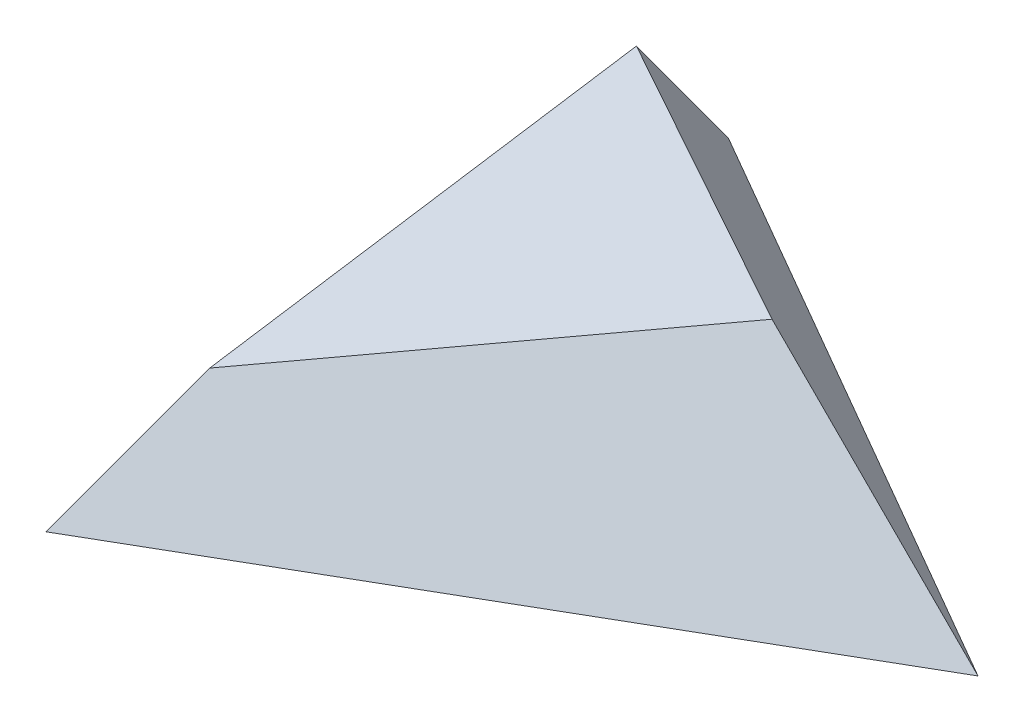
ISO-10303-21;
HEADER;
FILE_DESCRIPTION(('STEP AP214'),'2;1');
FILE_NAME('part.step','',(''),(''),'','','');
FILE_SCHEMA(('AUTOMOTIVE_DESIGN { 1 0 10303 214 1 1 1 1 }'));
ENDSEC;
DATA;
#1=APPLICATION_CONTEXT('core data for automotive mechanical design processes');
#2=APPLICATION_PROTOCOL_DEFINITION('international standard','automotive_design',2000,#1);
#3=PRODUCT_CONTEXT('',#1,'mechanical');
#4=PRODUCT('Part','Part','',(#3));
#5=PRODUCT_RELATED_PRODUCT_CATEGORY('part','',(#4));
#6=PRODUCT_DEFINITION_FORMATION('','',#4);
#7=PRODUCT_DEFINITION_CONTEXT('part definition',#1,'design');
#8=PRODUCT_DEFINITION('design','',#6,#7);
#9=PRODUCT_DEFINITION_SHAPE('','',#8);
#10=(LENGTH_UNIT() NAMED_UNIT(*) SI_UNIT(.MILLI.,.METRE.));
#11=(NAMED_UNIT(*) PLANE_ANGLE_UNIT() SI_UNIT($,.RADIAN.));
#12=(NAMED_UNIT(*) SI_UNIT($,.STERADIAN.) SOLID_ANGLE_UNIT());
#13=UNCERTAINTY_MEASURE_WITH_UNIT(LENGTH_MEASURE(1.E-05),#10,'distance_accuracy_value','');
#14=(GEOMETRIC_REPRESENTATION_CONTEXT(3) GLOBAL_UNCERTAINTY_ASSIGNED_CONTEXT((#13)) GLOBAL_UNIT_ASSIGNED_CONTEXT((#10,
#11,#12)) REPRESENTATION_CONTEXT('',''));
#15=CARTESIAN_POINT('',(0.,0.,0.));
#16=DIRECTION('',(0.,0.,1.));
#17=DIRECTION('',(1.,0.,0.));
#18=AXIS2_PLACEMENT_3D('',#15,#16,#17);
#19=CARTESIAN_POINT('',(0.,0.,0.));
#20=DIRECTION('',(0.,1.,0.));
#21=DIRECTION('',(0.,0.,1.));
#22=AXIS2_PLACEMENT_3D('',#19,#20,#21);
#23=PLANE('',#22);
#24=DIRECTION('',(0.866025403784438,0.,-0.5));
#25=VECTOR('',#24,1.);
#26=CARTESIAN_POINT('',(-30.,0.,51.9615242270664));
#27=LINE('',#26,#25);
#28=CARTESIAN_POINT('',(-30.,0.,51.9615242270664));
#29=VERTEX_POINT('',#28);
#30=CARTESIAN_POINT('',(60.,0.,0.));
#31=VERTEX_POINT('',#30);
#32=EDGE_CURVE('E90',#29,#31,#27,.T.);
#33=ORIENTED_EDGE('',*,*,#32,.F.);
#34=DIRECTION('',(0.,0.,1.));
#35=VECTOR('',#34,1.);
#36=CARTESIAN_POINT('',(-30.,0.,-51.9615242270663));
#37=LINE('',#36,#35);
#38=CARTESIAN_POINT('',(-30.,0.,-51.9615242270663));
#39=VERTEX_POINT('',#38);
#40=EDGE_CURVE('E107',#39,#29,#37,.T.);
#41=ORIENTED_EDGE('',*,*,#40,.F.);
#42=DIRECTION('',(-0.866025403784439,0.,-0.5));
#43=VECTOR('',#42,1.);
#44=CARTESIAN_POINT('',(60.,0.,0.));
#45=LINE('',#44,#43);
#46=EDGE_CURVE('E100',#31,#39,#45,.T.);
#47=ORIENTED_EDGE('',*,*,#46,.F.);
#48=EDGE_LOOP('',(#33,#41,#47));
#49=FACE_BOUND('',#48,.T.);
#50=ADVANCED_FACE('F48',(#49),#23,.F.);
#51=CARTESIAN_POINT('',(12.,12.,-20.7846096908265));
#52=DIRECTION('',(0.447213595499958,0.447213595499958,-0.774596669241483));
#53=DIRECTION('',(0.,0.866025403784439,0.5));
#54=AXIS2_PLACEMENT_3D('',#51,#52,#53);
#55=PLANE('',#54);
#56=DIRECTION('',(-0.891627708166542,0.154441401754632,-0.425614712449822));
#57=VECTOR('',#56,1.);
#58=CARTESIAN_POINT('',(10.1887252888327,34.5668139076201,-8.8013935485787));
#59=LINE('',#58,#57);
#60=CARTESIAN_POINT('',(28.6269186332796,31.3730813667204,0.));
#61=VERTEX_POINT('',#60);
#62=CARTESIAN_POINT('',(-10.890956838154,38.2180863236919,-18.8636905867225));
#63=VERTEX_POINT('',#62);
#64=EDGE_CURVE('E84',#61,#63,#59,.T.);
#65=ORIENTED_EDGE('',*,*,#64,.F.);
#66=DIRECTION('',(0.707106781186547,-0.707106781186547,0.));
#67=VECTOR('',#66,1.);
#68=CARTESIAN_POINT('',(0.,60.,0.));
#69=LINE('',#68,#67);
#70=EDGE_CURVE('E103',#61,#31,#69,.T.);
#71=ORIENTED_EDGE('',*,*,#70,.T.);
#72=ORIENTED_EDGE('',*,*,#46,.T.);
#73=DIRECTION('',(-0.353553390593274,-0.707106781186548,-0.612372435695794));
#74=VECTOR('',#73,1.);
#75=CARTESIAN_POINT('',(0.,60.,0.));
#76=LINE('',#75,#74);
#77=EDGE_CURVE('E53',#63,#39,#76,.T.);
#78=ORIENTED_EDGE('',*,*,#77,.F.);
#79=EDGE_LOOP('',(#65,#71,#72,#78));
#80=FACE_BOUND('',#79,.T.);
#81=ADVANCED_FACE('F98',(#80),#55,.T.);
#82=CARTESIAN_POINT('',(-24.,12.,0.));
#83=DIRECTION('',(-0.894427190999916,0.447213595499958,0.));
#84=DIRECTION('',(-0.447213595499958,-0.894427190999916,0.));
#85=AXIS2_PLACEMENT_3D('',#82,#83,#84);
#86=PLANE('',#85);
#87=DIRECTION('',(-0.168124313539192,-0.336248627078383,0.926645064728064));
#88=VECTOR('',#87,1.);
#89=CARTESIAN_POINT('',(-15.6824476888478,28.6351046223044,7.54540668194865));
#90=LINE('',#89,#88);
#91=CARTESIAN_POINT('',(-20.8727616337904,18.2544767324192,36.1526836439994));
#92=VERTEX_POINT('',#91);
#93=EDGE_CURVE('E66',#63,#92,#90,.T.);
#94=ORIENTED_EDGE('',*,*,#93,.F.);
#95=ORIENTED_EDGE('',*,*,#77,.T.);
#96=ORIENTED_EDGE('',*,*,#40,.T.);
#97=DIRECTION('',(-0.353553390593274,-0.707106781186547,0.612372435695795));
#98=VECTOR('',#97,1.);
#99=CARTESIAN_POINT('',(0.,60.,0.));
#100=LINE('',#99,#98);
#101=EDGE_CURVE('E60',#92,#29,#100,.T.);
#102=ORIENTED_EDGE('',*,*,#101,.F.);
#103=EDGE_LOOP('',(#94,#95,#96,#102));
#104=FACE_BOUND('',#103,.T.);
#105=ADVANCED_FACE('F93',(#104),#86,.T.);
#106=CARTESIAN_POINT('',(12.,12.,20.7846096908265));
#107=DIRECTION('',(0.447213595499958,0.447213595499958,0.774596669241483));
#108=DIRECTION('',(0.866025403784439,0.,-0.5));
#109=AXIS2_PLACEMENT_3D('',#106,#107,#108);
#110=PLANE('',#109);
#111=DIRECTION('',(0.78966519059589,0.209280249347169,-0.576741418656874));
#112=VECTOR('',#111,1.);
#113=CARTESIAN_POINT('',(5.59124202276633,25.2680735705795,16.8243819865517));
#114=LINE('',#113,#112);
#115=EDGE_CURVE('E12',#92,#61,#114,.T.);
#116=ORIENTED_EDGE('',*,*,#115,.F.);
#117=ORIENTED_EDGE('',*,*,#101,.T.);
#118=ORIENTED_EDGE('',*,*,#32,.T.);
#119=ORIENTED_EDGE('',*,*,#70,.F.);
#120=EDGE_LOOP('',(#116,#117,#118,#119));
#121=FACE_BOUND('',#120,.T.);
#122=ADVANCED_FACE('F50',(#121),#110,.T.);
#123=CARTESIAN_POINT('',(-30.0001,18.2544767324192,36.1526836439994));
#124=DIRECTION('',(0.,-0.940025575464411,-0.34110396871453));
#125=DIRECTION('',(0.,0.34110396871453,-0.940025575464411));
#126=AXIS2_PLACEMENT_3D('',#123,#124,#125);
#127=PLANE('',#126);
#128=ORIENTED_EDGE('',*,*,#64,.T.);
#129=ORIENTED_EDGE('',*,*,#93,.T.);
#130=ORIENTED_EDGE('',*,*,#115,.T.);
#131=EDGE_LOOP('',(#128,#129,#130));
#132=FACE_BOUND('',#131,.T.);
#133=ADVANCED_FACE('F85',(#132),#127,.F.);
#134=CLOSED_SHELL('',(#50,#81,#105,#122,#133));
#135=MANIFOLD_SOLID_BREP('B2',#134);
#136=ADVANCED_BREP_SHAPE_REPRESENTATION('',(#18,#135),#14);
#137=SHAPE_DEFINITION_REPRESENTATION(#9,#136);
ENDSEC;
END-ISO-10303-21;
